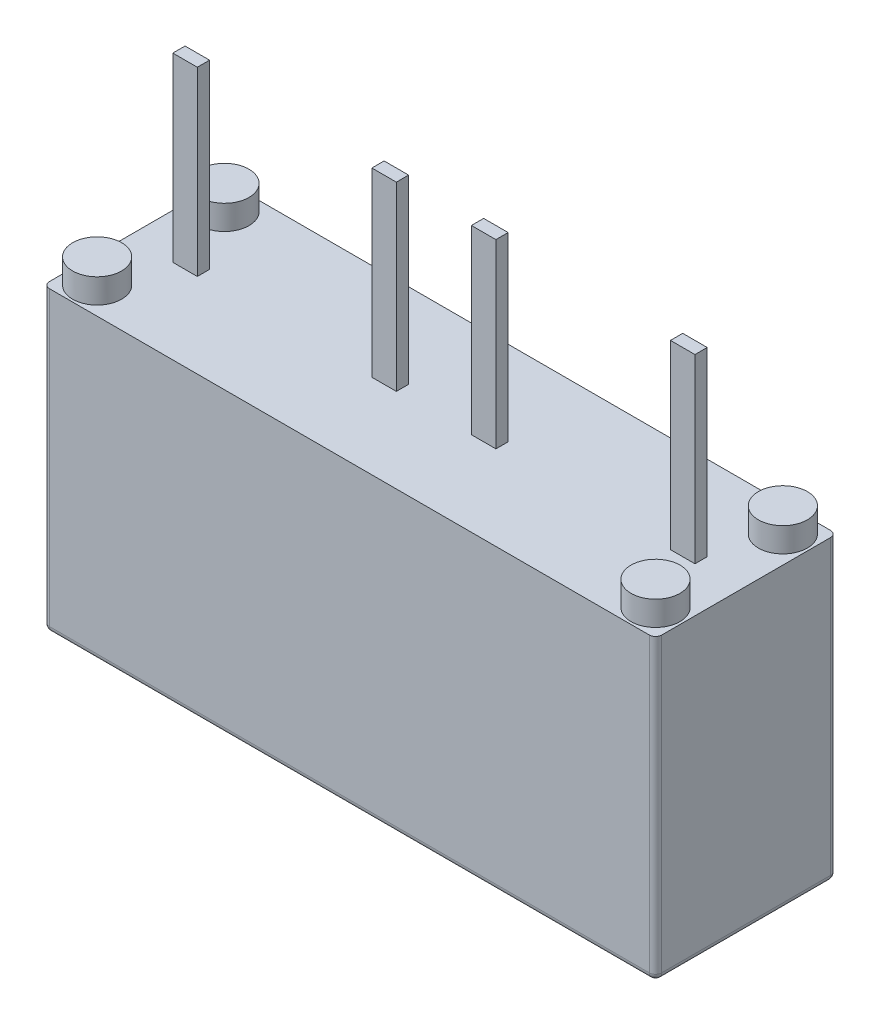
from build123d import *

# Parameters (mm, degrees)
SKETCH1_W               = 12.5
SKETCH1_H               = 3.7
BOSS_EXTRUDE1_DEPTH     = 3.05
FILLET1_R               = 0.127
SKETCH12_R              = 0.625
BOSS_EXTRUDE8_DEPTH     = 0.001
SKETCH14_W              = 0.155844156
SKETCH14_H              = 1
BOSS_EXTRUDE10_DEPTH    = 0.001
SKETCH15_W              = 0.315584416
SKETCH15_H              = 0.175324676
SKETCH15_W_2            = 0.315584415
PART_NUMBER_DEPTH       = 0.001
SKETCH2_R               = 0.5
BOSS_EXTRUDE11_DEPTH    = 0.5
MIRROR2_COPY_1_SKETCH_R = 0.5
MIRROR2_COPY_1_DEPTH    = 0.5
SKETCH16_W              = 0.5
SKETCH16_H              = 0.25
BOSS_EXTRUDE12_DEPTH    = 3.7


with BuildPart() as part:
    # Sketch1 → Boss-Extrude1 (new, symmetric)
    with BuildSketch(Plane(origin=(0, 0, 0), x_dir=(1, 0, 0), z_dir=(0, 1, 0))):
        Rectangle(SKETCH1_W, SKETCH1_H)
    extrude(amount=BOSS_EXTRUDE1_DEPTH, both=True)

    # Fillet1
    fillet1_edges = [part.edges().sort_by_distance(p)[0] for p in [
        (0, -3.05, 1.85),
        (-6.25, -3.05, 0),
        (0, -3.05, -1.85),
        (6.25, -3.05, 0),
        (6.25, 0, 1.85),
        (-6.25, 0, 1.85),
        (-6.25, 0, -1.85),
        (6.25, 0, -1.85),
    ]]
    fillet(fillet1_edges, radius=FILLET1_R)

    # Sketch12 → Boss-Extrude8 (add)
    with BuildSketch(Plane(origin=(0, -3.05, 0), x_dir=(-1, 0, 0), z_dir=(0, -1, 0))):
        with Locations(Location((5.337664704, 0.725256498, 0), (0, 0, 270))):
            Circle(SKETCH12_R)
        Polygon((-4.767808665, 0.401887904), (-5.208078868, -1.480706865), (-5.548883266, -1.401005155), (-5.270390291, -0.21016959), (-5.767010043, -0.559917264), (-5.406669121, 0.980900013), (-5.650100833, 1.037829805), (-5.134766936, 1.287763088), (-4.82243301, 0.844268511), (-5.065864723, 0.901198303), (-5.264428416, 0.05214023), align=None)
    extrude(amount=BOSS_EXTRUDE8_DEPTH)

    # Sketch14 → Boss-Extrude10 (add)
    # profile 1 of 14: a face of its own
    with BuildSketch(Plane.XZ.offset(3.05)):
        with BuildLine():
            Line((-5.930411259, 0.573168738), (-5.930411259, 1.573168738))
            Line((-5.930411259, 1.573168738), (-5.66093074, 1.573168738))
            add(Edge.make_bspline(
                [(-5.66093074, 1.573168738), (-5.648958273, 1.573126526), (-5.626026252, 1.573045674), (-5.593279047, 1.572530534), (-5.563717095, 1.571269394), (-5.537463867, 1.569706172), (-5.514446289, 1.567732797), (-5.494757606, 1.565290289), (-5.478210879, 1.562725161), (-5.468474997, 1.559990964), (-5.464096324, 1.558761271)],
                knots=[0, 0, 0, 0, 1.45237712, 2.781878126, 3.972677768, 5.041396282, 5.972228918, 6.774219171, 7.448710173, 8, 8, 8, 8], degree=3))
            add(Edge.make_bspline(
                [(-5.464096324, 1.558761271), (-5.458035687, 1.556632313), (-5.445976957, 1.552396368), (-5.428545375, 1.544172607), (-5.411950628, 1.534267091), (-5.396234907, 1.522581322), (-5.381384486, 1.509322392), (-5.36727424, 1.494433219), (-5.354210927, 1.477745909), (-5.341744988, 1.459658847), (-5.330429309, 1.440110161), (-5.320602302, 1.419076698), (-5.312610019, 1.396588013), (-5.305600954, 1.372856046), (-5.300392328, 1.347670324), (-5.296808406, 1.321155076), (-5.294527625, 1.293311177), (-5.294210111, 1.274269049), (-5.294047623, 1.264524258)],
                knots=[0, 0, 0, 0, 0.846149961, 1.683567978, 2.535100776, 3.389102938, 4.260422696, 5.155850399, 6.088615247, 7.050446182, 8.048882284, 9.061856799, 10.105243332, 11.191356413, 12.320760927, 13.490669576, 14.715852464, 16, 16, 16, 16], degree=3))
            add(Edge.make_bspline(
                [(-5.294047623, 1.264524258), (-5.294140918, 1.255658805), (-5.294324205, 1.238241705), (-5.296460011, 1.212710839), (-5.299622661, 1.188233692), (-5.304251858, 1.164897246), (-5.310400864, 1.142690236), (-5.317714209, 1.121542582), (-5.326142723, 1.101380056), (-5.336162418, 1.082542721), (-5.347087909, 1.064969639), (-5.358701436, 1.048600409), (-5.370969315, 1.033669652), (-5.383990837, 1.020115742), (-5.397405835, 1.007634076), (-5.41196814, 0.997019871), (-5.426805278, 0.987285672), (-5.44280155, 0.97895084), (-5.460659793, 0.97204105), (-5.480917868, 0.965905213), (-5.504073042, 0.960956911), (-5.530105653, 0.956998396), (-5.559013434, 0.953784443), (-5.590753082, 0.951375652), (-5.625406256, 0.949955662), (-5.649430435, 0.949848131), (-5.66194535, 0.949792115)],
                knots=[0, 0, 0, 0, 1.135396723, 2.23060449, 3.279591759, 4.295786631, 5.275377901, 6.228987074, 7.160814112, 8.071657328, 8.958908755, 9.810053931, 10.641024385, 11.43162038, 12.216736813, 12.984447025, 13.736746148, 14.488596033, 15.289898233, 16.186242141, 17.197511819, 18.320073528, 19.558272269, 20.922626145, 22.396903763, 24, 24, 24, 24], degree=3))
            Line((-5.66194535, 0.949792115), (-5.774567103, 0.949792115))
            Line((-5.774567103, 0.949792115), (-5.774567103, 0.573168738))
            Line((-5.774567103, 0.573168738), (-5.930411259, 0.573168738))
        make_face()
        with BuildLine():
            Line((-5.774567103, 1.404337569), (-5.774567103, 1.118623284))
            Line((-5.774567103, 1.118623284), (-5.672903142, 1.118623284))
            add(Edge.make_bspline(
                [(-5.672903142, 1.118623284), (-5.6647182, 1.118658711), (-5.649022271, 1.118726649), (-5.626492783, 1.119334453), (-5.605989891, 1.120318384), (-5.587514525, 1.121717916), (-5.571124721, 1.123479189), (-5.556770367, 1.125722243), (-5.544473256, 1.128237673), (-5.530894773, 1.132247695), (-5.516006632, 1.139118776), (-5.499879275, 1.149669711), (-5.48546536, 1.162927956), (-5.47285882, 1.178593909), (-5.46245361, 1.19659899), (-5.455215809, 1.216812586), (-5.450561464, 1.238811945), (-5.450120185, 1.254150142), (-5.449891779, 1.262089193)],
                knots=[0, 0, 0, 0, 1.284283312, 2.462817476, 3.536098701, 4.504784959, 5.369772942, 6.121838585, 6.783804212, 7.337847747, 8.3400838, 9.343892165, 10.350558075, 11.399797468, 12.488501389, 13.596588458, 14.755994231, 16, 16, 16, 16], degree=3))
            add(Edge.make_bspline(
                [(-5.449891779, 1.262089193), (-5.450100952, 1.270167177), (-5.450505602, 1.285794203), (-5.455423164, 1.308112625), (-5.462764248, 1.328629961), (-5.47376598, 1.346580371), (-5.486416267, 1.362380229), (-5.500703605, 1.375710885), (-5.516814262, 1.385632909), (-5.531472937, 1.392009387), (-5.544933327, 1.395790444), (-5.557675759, 1.39782975), (-5.572833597, 1.399832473), (-5.590482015, 1.401725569), (-5.610595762, 1.402825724), (-5.633194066, 1.40357807), (-5.658289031, 1.404250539), (-5.67587882, 1.404307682), (-5.685078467, 1.404337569)],
                knots=[0, 0, 0, 0, 1.217310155, 2.3549115, 3.434183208, 4.491984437, 5.51587148, 6.484436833, 7.425091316, 8.358344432, 8.888574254, 9.53159621, 10.304262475, 11.197434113, 12.210261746, 13.34451227, 14.611151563, 16, 16, 16, 16], degree=3))
            Line((-5.685078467, 1.404337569), (-5.774567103, 1.404337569))
        make_face(mode=Mode.SUBTRACT)
    # profile 2 of 14: a face of its own
    with BuildSketch(Plane.XZ.offset(3.05)):
        with Locations((-5.086255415, 1.073168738)):
            Rectangle(SKETCH14_W, SKETCH14_H)
    # profile 3 of 14: a face of its own
    with BuildSketch(Plane.XZ.offset(3.05)):
        with BuildLine():
            Line((-4.320021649, 0.936805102), (-4.164177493, 0.871870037))
            add(Edge.make_bspline(
                [(-4.164177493, 0.871870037), (-4.167396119, 0.8587699), (-4.173667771, 0.833243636), (-4.185532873, 0.79675943), (-4.198589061, 0.762907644), (-4.213526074, 0.731877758), (-4.229831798, 0.703397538), (-4.24794414, 0.677747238), (-4.267522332, 0.654795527), (-4.288677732, 0.634596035), (-4.311376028, 0.617215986), (-4.334979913, 0.601728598), (-4.360098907, 0.589032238), (-4.386381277, 0.578312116), (-4.41403365, 0.570343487), (-4.44284593, 0.564346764), (-4.472941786, 0.56091516), (-4.493443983, 0.560428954), (-4.503869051, 0.560181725)],
                knots=[0, 0, 0, 0, 1.282586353, 2.499182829, 3.646034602, 4.730797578, 5.771318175, 6.763713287, 7.712684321, 8.6363956, 9.539720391, 10.428356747, 11.317388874, 12.212151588, 13.124116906, 14.050177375, 15.008543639, 16, 16, 16, 16], degree=3))
            add(Edge.make_bspline(
                [(-4.503869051, 0.560181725), (-4.516949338, 0.560475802), (-4.542573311, 0.561051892), (-4.579963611, 0.567250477), (-4.615543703, 0.576668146), (-4.64924945, 0.590191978), (-4.681120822, 0.607478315), (-4.710821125, 0.628889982), (-4.739043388, 0.653629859), (-4.755452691, 0.672919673), (-4.763812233, 0.68274666)],
                knots=[0, 0, 0, 0, 1.053414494, 2.063614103, 3.046293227, 4.01520277, 4.983805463, 5.961130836, 6.961320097, 8, 8, 8, 8], degree=3))
            add(Edge.make_bspline(
                [(-4.763812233, 0.68274666), (-4.77300105, 0.69487931), (-4.79151277, 0.719321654), (-4.814753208, 0.759627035), (-4.834519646, 0.802928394), (-4.850697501, 0.849264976), (-4.863307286, 0.898688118), (-4.872123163, 0.951221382), (-4.877417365, 1.006839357), (-4.878109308, 1.044950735), (-4.878463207, 1.064443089)],
                knots=[0, 0, 0, 0, 0.898140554, 1.809387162, 2.740718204, 3.705966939, 4.703925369, 5.74945803, 6.848943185, 8, 8, 8, 8], degree=3))
            add(Edge.make_bspline(
                [(-4.878463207, 1.064443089), (-4.878139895, 1.085020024), (-4.877510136, 1.125100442), (-4.871840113, 1.18345372), (-4.863196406, 1.238466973), (-4.850308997, 1.289935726), (-4.834164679, 1.338155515), (-4.81421842, 1.382825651), (-4.791058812, 1.424413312), (-4.77216322, 1.449250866), (-4.762797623, 1.461561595)],
                knots=[0, 0, 0, 0, 1.171098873, 2.281104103, 3.334483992, 4.338438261, 5.297974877, 6.225356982, 7.120398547, 8, 8, 8, 8], degree=3))
            add(Edge.make_bspline(
                [(-4.762797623, 1.461561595), (-4.754294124, 1.471512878), (-4.737535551, 1.491124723), (-4.708891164, 1.516520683), (-4.678118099, 1.538108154), (-4.64522749, 1.555782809), (-4.610072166, 1.569529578), (-4.572824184, 1.579229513), (-4.533334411, 1.584952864), (-4.506323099, 1.58574866), (-4.492505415, 1.586155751)],
                knots=[0, 0, 0, 0, 1.017460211, 2.005195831, 2.96880208, 3.936538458, 4.903086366, 5.898753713, 6.925103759, 8, 8, 8, 8], degree=3))
            add(Edge.make_bspline(
                [(-4.492505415, 1.586155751), (-4.481197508, 1.585885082), (-4.458972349, 1.585353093), (-4.426383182, 1.581100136), (-4.395333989, 1.573621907), (-4.365521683, 1.563812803), (-4.337207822, 1.550688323), (-4.310310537, 1.534762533), (-4.284724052, 1.516087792), (-4.269215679, 1.501569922), (-4.261377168, 1.49423205)],
                knots=[0, 0, 0, 0, 1.062174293, 2.087653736, 3.080296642, 4.058948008, 5.03139012, 6.005719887, 6.992016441, 8, 8, 8, 8], degree=3))
            add(Edge.make_bspline(
                [(-4.261377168, 1.49423205), (-4.255927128, 1.488576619), (-4.244821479, 1.477052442), (-4.229867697, 1.457640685), (-4.21602309, 1.436262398), (-4.203535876, 1.412826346), (-4.19192691, 1.387561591), (-4.181370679, 1.360338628), (-4.172084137, 1.331095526), (-4.166853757, 1.310817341), (-4.164177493, 1.300441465)],
                knots=[0, 0, 0, 0, 0.858002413, 1.748367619, 2.673305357, 3.63929672, 4.648357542, 5.711115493, 6.828831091, 8, 8, 8, 8], degree=3))
            Line((-4.164177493, 1.300441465), (-4.320021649, 1.248493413))
            add(Edge.make_bspline(
                [(-4.320021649, 1.248493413), (-4.321486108, 1.25514464), (-4.324335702, 1.268086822), (-4.330056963, 1.286764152), (-4.337022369, 1.304111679), (-4.344600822, 1.320545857), (-4.353726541, 1.335498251), (-4.36327233, 1.349683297), (-4.374465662, 1.362250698), (-4.386291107, 1.373860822), (-4.399165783, 1.383893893), (-4.412344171, 1.39296724), (-4.426219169, 1.400511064), (-4.440732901, 1.406578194), (-4.455713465, 1.411488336), (-4.471272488, 1.414941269), (-4.487374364, 1.417032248), (-4.498316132, 1.417226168), (-4.503869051, 1.417324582)],
                knots=[0, 0, 0, 0, 1.200071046, 2.335138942, 3.437621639, 4.493482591, 5.51985659, 6.521917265, 7.50210956, 8.480124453, 9.438987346, 10.374745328, 11.297656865, 12.216555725, 13.143999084, 14.072438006, 15.021767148, 16, 16, 16, 16], degree=3))
            add(Edge.make_bspline(
                [(-4.503869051, 1.417324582), (-4.511727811, 1.417091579), (-4.527194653, 1.416633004), (-4.549854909, 1.412984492), (-4.571294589, 1.406531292), (-4.591836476, 1.398059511), (-4.611135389, 1.386772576), (-4.62940617, 1.373103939), (-4.646157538, 1.356640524), (-4.662211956, 1.338122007), (-4.676759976, 1.316665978), (-4.689112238, 1.291868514), (-4.699300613, 1.263818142), (-4.708076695, 1.232716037), (-4.714642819, 1.198357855), (-4.719199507, 1.160796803), (-4.722043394, 1.120087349), (-4.722422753, 1.091842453), (-4.722619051, 1.07722718)],
                knots=[0, 0, 0, 0, 0.827686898, 1.628972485, 2.409099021, 3.181967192, 3.964173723, 4.757978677, 5.579415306, 6.433460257, 7.33665582, 8.302235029, 9.343905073, 10.476376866, 11.703364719, 13.024698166, 14.460435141, 16, 16, 16, 16], degree=3))
            add(Edge.make_bspline(
                [(-4.722619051, 1.07722718), (-4.722397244, 1.062072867), (-4.72197011, 1.03289025), (-4.719480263, 0.990740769), (-4.714747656, 0.95201505), (-4.708689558, 0.916560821), (-4.700399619, 0.884585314), (-4.690271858, 0.856068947), (-4.678606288, 0.830733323), (-4.664690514, 0.808910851), (-4.649271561, 0.79007156), (-4.632878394, 0.773714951), (-4.615194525, 0.76005128), (-4.596693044, 0.748471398), (-4.57686601, 0.73969647), (-4.555947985, 0.733726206), (-4.534063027, 0.729596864), (-4.519040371, 0.729210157), (-4.511377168, 0.729012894)],
                knots=[0, 0, 0, 0, 1.588381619, 3.058741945, 4.422565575, 5.675514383, 6.825848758, 7.879737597, 8.8437938, 9.742560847, 10.584031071, 11.391113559, 12.163968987, 12.921455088, 13.673648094, 14.427376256, 15.197789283, 16, 16, 16, 16], degree=3))
            add(Edge.make_bspline(
                [(-4.511377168, 0.729012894), (-4.505756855, 0.729186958), (-4.49460773, 0.729532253), (-4.478201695, 0.731730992), (-4.462370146, 0.735662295), (-4.447110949, 0.741116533), (-4.432489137, 0.748312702), (-4.41835469, 0.756838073), (-4.404993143, 0.767085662), (-4.392057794, 0.778721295), (-4.379857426, 0.79210433), (-4.368707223, 0.807491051), (-4.358347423, 0.824606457), (-4.348840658, 0.843556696), (-4.340126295, 0.864219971), (-4.332442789, 0.886754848), (-4.325489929, 0.911048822), (-4.321879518, 0.928054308), (-4.320021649, 0.936805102)],
                knots=[0, 0, 0, 0, 0.874040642, 1.73385169, 2.568061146, 3.406503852, 4.248567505, 5.09821747, 5.96915136, 6.862782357, 7.800986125, 8.779254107, 9.812897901, 10.908933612, 12.073249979, 13.297367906, 14.609261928, 16, 16, 16, 16], degree=3))
        make_face()
    # profile 4 of 14: a face of its own
    with BuildSketch(Plane.XZ.offset(3.05)):
        Polygon((-4.008333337, 0.573168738), (-4.008333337, 1.573168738), (-3.852489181, 1.573168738), (-3.852489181, 1.091837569), (-3.472416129, 1.573168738), (-3.274567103, 1.573168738), (-3.58869048, 1.192081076), (-3.26158009, 0.573168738), (-3.481953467, 0.573168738), (-3.709632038, 1.045165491), (-3.852489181, 0.871870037), (-3.852489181, 0.573168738), align=None)
    # profile 5 of 14: a face of its own
    with BuildSketch(Plane.XZ.offset(3.05)):
        Polygon((-3.177164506, 0.573168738), (-3.177164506, 1.573168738), (-2.566774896, 1.573168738), (-2.566774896, 1.404337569), (-3.02132035, 1.404337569), (-3.02132035, 1.170571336), (-2.592748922, 1.170571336), (-2.592748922, 1.01472718), (-3.02132035, 1.01472718), (-3.02132035, 0.741999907), (-2.553787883, 0.741999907), (-2.553787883, 0.573168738), align=None)
    # profile 6 of 14: a face of its own
    with BuildSketch(Plane.XZ.offset(3.05)):
        with BuildLine():
            Line((-2.41093074, 0.573168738), (-2.41093074, 1.573168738))
            Line((-2.41093074, 1.573168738), (-2.059875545, 1.573168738))
            add(Edge.make_bspline(
                [(-2.059875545, 1.573168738), (-2.049052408, 1.573089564), (-2.028210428, 1.5729371), (-1.998082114, 1.571814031), (-1.97041902, 1.569488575), (-1.945064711, 1.566810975), (-1.922235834, 1.56298159), (-1.901765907, 1.558324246), (-1.883682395, 1.552948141), (-1.862708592, 1.544587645), (-1.839208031, 1.530753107), (-1.813936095, 1.50953802), (-1.791453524, 1.48325734), (-1.771718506, 1.452520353), (-1.755427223, 1.41764306), (-1.744003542, 1.37900532), (-1.736664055, 1.337178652), (-1.735965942, 1.308117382), (-1.735606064, 1.293136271)],
                knots=[0, 0, 0, 0, 1.04688713, 2.015977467, 2.915189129, 3.731617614, 4.481301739, 5.152637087, 5.761127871, 6.304197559, 7.333207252, 8.382830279, 9.482073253, 10.665313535, 11.906396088, 13.191683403, 14.552310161, 16, 16, 16, 16], degree=3))
            add(Edge.make_bspline(
                [(-1.735606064, 1.293136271), (-1.735828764, 1.283593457), (-1.736263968, 1.264944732), (-1.73884566, 1.237658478), (-1.743453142, 1.211771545), (-1.750266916, 1.187401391), (-1.758462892, 1.164271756), (-1.768911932, 1.142707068), (-1.781111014, 1.122505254), (-1.795132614, 1.103826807), (-1.810822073, 1.086684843), (-1.828173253, 1.071214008), (-1.847069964, 1.057303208), (-1.867759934, 1.045452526), (-1.889690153, 1.034714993), (-1.913401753, 1.026103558), (-1.938621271, 1.018902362), (-1.956150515, 1.015602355), (-1.965110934, 1.013915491)],
                knots=[0, 0, 0, 0, 1.148725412, 2.24485837, 3.2956961, 4.308991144, 5.287710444, 6.245445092, 7.187969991, 8.124285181, 9.052065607, 9.980417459, 10.918430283, 11.870785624, 12.846723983, 13.853982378, 14.9030207, 16, 16, 16, 16], degree=3))
            add(Edge.make_bspline(
                [(-1.965110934, 1.013915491), (-1.956227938, 1.00760899), (-1.938847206, 0.995269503), (-1.914789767, 0.975096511), (-1.893269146, 0.953953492), (-1.87678348, 0.935244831), (-1.864346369, 0.918539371), (-1.853991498, 0.903972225), (-1.842876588, 0.887089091), (-1.830857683, 0.867968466), (-1.81815825, 0.846469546), (-1.804561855, 0.82272515), (-1.790133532, 0.796654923), (-1.780300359, 0.778467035), (-1.77517587, 0.768988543)],
                knots=[0, 0, 0, 0, 1.250008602, 2.445803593, 3.598666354, 4.710220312, 5.303348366, 5.98833631, 6.761333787, 7.622934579, 8.580231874, 9.626942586, 10.763297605, 12, 12, 12, 12], degree=3))
            Line((-1.77517587, 0.768988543), (-1.670670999, 0.573168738))
            Line((-1.670670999, 0.573168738), (-1.889623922, 0.573168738))
            Line((-1.889623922, 0.573168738), (-2.005492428, 0.789483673))
            add(Edge.make_bspline(
                [(-2.005492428, 0.789483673), (-2.010478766, 0.79882835), (-2.019968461, 0.816612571), (-2.033802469, 0.841825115), (-2.046374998, 0.864248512), (-2.057485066, 0.88410925), (-2.067648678, 0.900999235), (-2.076324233, 0.915392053), (-2.083983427, 0.926848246), (-2.092248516, 0.938422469), (-2.101899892, 0.950064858), (-2.113970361, 0.961556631), (-2.126316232, 0.970811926), (-2.13963391, 0.977907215), (-2.155052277, 0.98324112), (-2.173823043, 0.986249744), (-2.196313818, 0.9886272), (-2.212599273, 0.988708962), (-2.221401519, 0.988753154)],
                knots=[0, 0, 0, 0, 1.60136501, 3.047620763, 4.347844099, 5.488187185, 6.487883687, 7.328020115, 8.028596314, 8.570701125, 9.478104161, 10.309984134, 11.085182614, 11.803449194, 12.582885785, 13.539658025, 14.670191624, 16, 16, 16, 16], degree=3))
            Line((-2.221401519, 0.988753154), (-2.255086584, 0.988753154))
            Line((-2.255086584, 0.988753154), (-2.255086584, 0.573168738))
            Line((-2.255086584, 0.573168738), (-2.41093074, 0.573168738))
        make_face()
        with BuildLine():
            Line((-2.255086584, 1.157584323), (-2.121766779, 1.157584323))
            add(Edge.make_bspline(
                [(-2.121766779, 1.157584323), (-2.112026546, 1.157641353), (-2.093492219, 1.157749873), (-2.067106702, 1.158068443), (-2.043500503, 1.158929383), (-2.022730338, 1.159904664), (-2.004657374, 1.161078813), (-1.98940683, 1.162581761), (-1.976885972, 1.164631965), (-1.963951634, 1.167453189), (-1.950238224, 1.172664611), (-1.935818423, 1.181423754), (-1.922757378, 1.192278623), (-1.911591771, 1.205832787), (-1.902300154, 1.221788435), (-1.895924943, 1.240323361), (-1.891990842, 1.26117861), (-1.891636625, 1.275868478), (-1.89145022, 1.283598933)],
                knots=[0, 0, 0, 0, 1.530151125, 2.911667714, 4.144992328, 5.240737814, 6.177978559, 6.99000054, 7.646825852, 8.170085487, 9.068012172, 9.935431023, 10.810237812, 11.723128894, 12.67998143, 13.694953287, 14.786982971, 16, 16, 16, 16], degree=3))
            add(Edge.make_bspline(
                [(-1.89145022, 1.283598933), (-1.891646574, 1.290989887), (-1.892022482, 1.305139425), (-1.895878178, 1.325214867), (-1.902361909, 1.343040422), (-1.911624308, 1.35846041), (-1.923113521, 1.37148697), (-1.936397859, 1.382539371), (-1.951618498, 1.391353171), (-1.962867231, 1.395123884), (-1.96856061, 1.397032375)],
                knots=[0, 0, 0, 0, 1.194031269, 2.285901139, 3.289564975, 4.246236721, 5.176404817, 6.085300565, 7.030903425, 8, 8, 8, 8], degree=3))
            add(Edge.make_bspline(
                [(-1.96856061, 1.397032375), (-1.971125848, 1.397599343), (-1.977231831, 1.398948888), (-1.987998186, 1.400531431), (-2.001827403, 1.40161214), (-2.018605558, 1.402623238), (-2.038361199, 1.403391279), (-2.061088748, 1.404058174), (-2.086796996, 1.404111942), (-2.10492442, 1.404259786), (-2.114461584, 1.404337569)],
                knots=[0, 0, 0, 0, 0.430892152, 1.025643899, 1.783105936, 2.70574662, 3.782977, 5.026178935, 6.435419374, 8, 8, 8, 8], degree=3))
            Line((-2.114461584, 1.404337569), (-2.255086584, 1.404337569))
            Line((-2.255086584, 1.404337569), (-2.255086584, 1.157584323))
        make_face(mode=Mode.SUBTRACT)
    # profile 7 of 14: a face of its own
    with BuildSketch(Plane.XZ.offset(3.05)):
        with Locations((-1.501839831, 1.073168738)):
            Rectangle(SKETCH14_W, SKETCH14_H)
    # profile 8 of 14: a face of its own
    with BuildSketch(Plane.XZ.offset(3.05)):
        Polygon((-1.255086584, 0.573168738), (-1.255086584, 1.573168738), (-1.092343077, 1.573168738), (-0.748593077, 0.90535218), (-0.748593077, 1.573168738), (-0.592748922, 1.573168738), (-0.592748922, 0.573168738), (-0.761174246, 0.573168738), (-1.099242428, 1.225360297), (-1.099242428, 0.573168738), align=None)
    # profile 9 of 14: a face of its own
    with BuildSketch(Plane.XZ.offset(3.05)):
        with BuildLine():
            Line((-0.047294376, 0.936805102), (-0.047294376, 1.105636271))
            Line((-0.047294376, 1.105636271), (0.303354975, 1.105636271))
            Line((0.303354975, 1.105636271), (0.303354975, 0.712779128))
            add(Edge.make_bspline(
                [(0.303354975, 0.712779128), (0.298682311, 0.707579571), (0.289244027, 0.697077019), (0.273700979, 0.682169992), (0.256630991, 0.668000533), (0.238092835, 0.654476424), (0.21832226, 0.641171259), (0.197148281, 0.628458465), (0.174398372, 0.616459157), (0.142672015, 0.601230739), (0.101918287, 0.584842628), (0.052118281, 0.570859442), (0.002276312, 0.561819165), (-0.031090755, 0.560725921), (-0.04770022, 0.560181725)],
                knots=[0, 0, 0, 0, 0.640095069, 1.292924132, 1.970305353, 2.670365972, 3.393721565, 4.15229731, 4.931044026, 5.748453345, 7.375093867, 8.945946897, 10.479752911, 12, 12, 12, 12], degree=3))
            add(Edge.make_bspline(
                [(-0.04770022, 0.560181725), (-0.057648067, 0.560409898), (-0.07730736, 0.56086082), (-0.106414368, 0.563444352), (-0.134608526, 0.568149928), (-0.161885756, 0.574605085), (-0.188228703, 0.583049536), (-0.21383544, 0.593055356), (-0.238333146, 0.605385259), (-0.262087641, 0.619112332), (-0.284504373, 0.635095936), (-0.306194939, 0.652425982), (-0.326274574, 0.672072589), (-0.345115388, 0.693480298), (-0.363126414, 0.716458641), (-0.379741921, 0.741424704), (-0.394901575, 0.768390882), (-0.409122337, 0.796915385), (-0.421894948, 0.827038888), (-0.432783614, 0.858603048), (-0.442223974, 0.891353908), (-0.449640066, 0.925540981), (-0.455498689, 0.960965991), (-0.459731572, 0.997669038), (-0.462488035, 1.035653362), (-0.462747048, 1.061461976), (-0.462878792, 1.074589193)],
                knots=[0, 0, 0, 0, 0.96294793, 1.903012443, 2.825402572, 3.727352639, 4.613530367, 5.501013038, 6.385229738, 7.265535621, 8.153718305, 9.047361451, 9.95019023, 10.868482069, 11.806149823, 12.77395942, 13.767900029, 14.798508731, 15.857606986, 16.932193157, 18.028419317, 19.154653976, 20.31598268, 21.50241393, 22.729635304, 24, 24, 24, 24], degree=3))
            add(Edge.make_bspline(
                [(-0.462878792, 1.074589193), (-0.46274577, 1.087986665), (-0.46248416, 1.114335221), (-0.459748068, 1.153066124), (-0.455483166, 1.190370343), (-0.449768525, 1.226182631), (-0.441894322, 1.260482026), (-0.432730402, 1.293351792), (-0.421463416, 1.324683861), (-0.408726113, 1.35450231), (-0.394513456, 1.382632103), (-0.379298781, 1.409070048), (-0.363136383, 1.433683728), (-0.345721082, 1.456291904), (-0.327593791, 1.477273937), (-0.308111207, 1.49617588), (-0.287933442, 1.513550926), (-0.26640474, 1.528733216), (-0.244121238, 1.542539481), (-0.220413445, 1.553970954), (-0.195854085, 1.564011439), (-0.170134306, 1.572140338), (-0.143334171, 1.578425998), (-0.115448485, 1.582769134), (-0.086593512, 1.585822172), (-0.066986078, 1.586043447), (-0.057034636, 1.586155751)],
                knots=[0, 0, 0, 0, 1.312030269, 2.580345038, 3.800688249, 4.988959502, 6.130087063, 7.24577612, 8.3291513, 9.388705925, 10.419771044, 11.414082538, 12.375082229, 13.301312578, 14.207494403, 15.088254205, 15.957754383, 16.812618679, 17.66591557, 18.52219064, 19.38705966, 20.262872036, 21.161173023, 22.080434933, 23.025755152, 24, 24, 24, 24], degree=3))
            add(Edge.make_bspline(
                [(-0.057034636, 1.586155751), (-0.045121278, 1.585929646), (-0.021912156, 1.585489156), (0.012045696, 1.58183497), (0.044100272, 1.575460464), (0.074506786, 1.567143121), (0.102902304, 1.555773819), (0.129668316, 1.542261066), (0.154430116, 1.525875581), (0.177544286, 1.507345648), (0.198733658, 1.486364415), (0.217842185, 1.462917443), (0.234878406, 1.437151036), (0.250284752, 1.409300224), (0.263073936, 1.378764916), (0.27456124, 1.346182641), (0.283615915, 1.31111288), (0.288081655, 1.286875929), (0.290367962, 1.274467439)],
                knots=[0, 0, 0, 0, 1.106718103, 2.156063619, 3.167949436, 4.140832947, 5.080279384, 6.00497985, 6.921830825, 7.833627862, 8.753510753, 9.686947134, 10.638631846, 11.620184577, 12.639304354, 13.710570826, 14.827890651, 16, 16, 16, 16], degree=3))
            Line((0.290367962, 1.274467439), (0.134523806, 1.248493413))
            add(Edge.make_bspline(
                [(0.134523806, 1.248493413), (0.132849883, 1.255145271), (0.129573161, 1.26816636), (0.123317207, 1.286939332), (0.115660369, 1.304386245), (0.107508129, 1.320861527), (0.098087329, 1.335981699), (0.087643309, 1.349847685), (0.076379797, 1.362685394), (0.06389533, 1.374050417), (0.050682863, 1.384156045), (0.036969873, 1.393234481), (0.022319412, 1.400403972), (0.007407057, 1.406911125), (-0.008387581, 1.411434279), (-0.024705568, 1.414980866), (-0.041696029, 1.417014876), (-0.053241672, 1.41722076), (-0.059063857, 1.417324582)],
                knots=[0, 0, 0, 0, 1.177468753, 2.304908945, 3.392157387, 4.44646936, 5.458353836, 6.445477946, 7.424370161, 8.386026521, 9.338381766, 10.278981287, 11.203455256, 12.135194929, 13.068453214, 14.018255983, 15.000655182, 16, 16, 16, 16], degree=3))
            add(Edge.make_bspline(
                [(-0.059063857, 1.417324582), (-0.06807356, 1.417112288), (-0.085773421, 1.416695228), (-0.111647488, 1.412775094), (-0.136173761, 1.406206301), (-0.1594658, 1.397336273), (-0.181365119, 1.385609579), (-0.201906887, 1.371353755), (-0.221124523, 1.354508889), (-0.239045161, 1.335257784), (-0.255115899, 1.313194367), (-0.26916576, 1.288504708), (-0.280923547, 1.261127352), (-0.29040858, 1.231055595), (-0.297855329, 1.198267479), (-0.303257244, 1.162805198), (-0.306551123, 1.124638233), (-0.306869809, 1.098337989), (-0.307034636, 1.084735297)],
                knots=[0, 0, 0, 0, 0.921848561, 1.811002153, 2.670935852, 3.517043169, 4.356494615, 5.20737657, 6.07109315, 6.967737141, 7.894254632, 8.858726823, 9.869747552, 10.938357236, 12.082205, 13.308268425, 14.607815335, 16, 16, 16, 16], degree=3))
            add(Edge.make_bspline(
                [(-0.307034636, 1.084735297), (-0.306798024, 1.070117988), (-0.306339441, 1.041787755), (-0.302893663, 1.000636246), (-0.297106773, 0.962165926), (-0.288775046, 0.926357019), (-0.278324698, 0.893178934), (-0.265482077, 0.862720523), (-0.250453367, 0.834822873), (-0.238046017, 0.818296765), (-0.231953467, 0.810181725)],
                knots=[0, 0, 0, 0, 1.209924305, 2.344989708, 3.415650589, 4.427521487, 5.38553267, 6.291346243, 7.16097645, 8, 8, 8, 8], degree=3))
            add(Edge.make_bspline(
                [(-0.231953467, 0.810181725), (-0.226494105, 0.803675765), (-0.215763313, 0.790887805), (-0.19723048, 0.774499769), (-0.177683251, 0.760183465), (-0.156362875, 0.748879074), (-0.133736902, 0.739812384), (-0.109582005, 0.733641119), (-0.084091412, 0.729609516), (-0.066588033, 0.72921467), (-0.057643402, 0.729012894)],
                knots=[0, 0, 0, 0, 1.020747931, 2.006357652, 2.968701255, 3.930183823, 4.9021189, 5.895229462, 6.924413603, 8, 8, 8, 8], degree=3))
            add(Edge.make_bspline(
                [(-0.057643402, 0.729012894), (-0.049035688, 0.729292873), (-0.031516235, 0.729862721), (-0.005101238, 0.734403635), (0.021866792, 0.741317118), (0.049048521, 0.751002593), (0.075656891, 0.763294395), (0.101270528, 0.777521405), (0.125261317, 0.793978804), (0.140098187, 0.806407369), (0.147510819, 0.81261679)],
                knots=[0, 0, 0, 0, 0.913346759, 1.858953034, 2.837757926, 3.866620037, 4.917326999, 5.946088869, 6.973847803, 8, 8, 8, 8], degree=3))
            Line((0.147510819, 0.81261679), (0.147510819, 0.936805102))
            Line((0.147510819, 0.936805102), (-0.047294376, 0.936805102))
        make_face()
    # profile 10 of 14: a face of its own
    with BuildSketch(Plane.XZ.offset(3.05)):
        Polygon((1.306378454, 0.573168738), (1.098383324, 1.573168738), (1.256865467, 1.573168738), (1.390591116, 0.881204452), (1.534259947, 1.573168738), (1.741037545, 1.573168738), (1.88409761, 0.868217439), (2.017823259, 1.573168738), (2.176305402, 1.573168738), (1.971557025, 0.573168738), (1.79034761, 0.573168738), (1.637344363, 1.32722718), (1.480891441, 0.573168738), align=None)
    # profile 11 of 14: a face of its own
    with BuildSketch(Plane.XZ.offset(3.05)):
        Polygon((2.343837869, 0.573168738), (2.343837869, 1.573168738), (2.499682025, 1.573168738), (2.499682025, 1.05084731), (2.699966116, 1.300441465), (2.895785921, 1.300441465), (2.685761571, 1.039077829), (2.908772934, 0.573168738), (2.740550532, 0.573168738), (2.580445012, 0.907381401), (2.499682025, 0.806934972), (2.499682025, 0.573168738), align=None)
    # profile 12 of 14: a face of its own
    with BuildSketch(Plane.XZ.offset(3.05)):
        Polygon((2.965915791, 0.560181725), (3.17086709, 1.586155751), (3.303578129, 1.586155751), (3.09862683, 0.560181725), align=None)
    # profile 13 of 14: a face of its own
    with BuildSketch(Plane.XZ.offset(3.05)):
        Polygon((3.678902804, 0.573168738), (3.678902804, 0.985100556), (3.380201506, 1.573168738), (3.553699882, 1.573168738), (3.764535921, 1.164686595), (3.960152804, 1.573168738), (4.133448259, 1.573168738), (3.83474696, 0.983680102), (3.83474696, 0.573168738), align=None)
    # profile 14 of 14: a face of its own
    with BuildSketch(Plane.XZ.offset(3.05)):
        with BuildLine():
            Line((4.456824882, 0.573168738), (4.300980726, 0.573168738))
            Line((4.300980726, 0.573168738), (4.300980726, 1.300441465))
            Line((4.300980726, 1.300441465), (4.443837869, 1.300441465))
            Line((4.443837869, 1.300441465), (4.443837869, 1.197154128))
            add(Edge.make_bspline(
                [(4.443837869, 1.197154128), (4.446864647, 1.202912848), (4.45269446, 1.214004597), (4.461366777, 1.229835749), (4.469805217, 1.244159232), (4.478419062, 1.256555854), (4.486219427, 1.267770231), (4.49422271, 1.277088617), (4.501829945, 1.285010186), (4.511527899, 1.293439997), (4.52435564, 1.301425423), (4.54074876, 1.308477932), (4.558425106, 1.312589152), (4.570575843, 1.313145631), (4.57675183, 1.313428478)],
                knots=[0, 0, 0, 0, 1.247976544, 2.403700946, 3.462962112, 4.43467857, 5.299009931, 6.081551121, 6.788109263, 7.404564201, 8.542080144, 9.670008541, 10.815710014, 12, 12, 12, 12], degree=3))
            add(Edge.make_bspline(
                [(4.57675183, 1.313428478), (4.58552824, 1.313026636), (4.603086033, 1.312222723), (4.62887778, 1.304746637), (4.654167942, 1.293435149), (4.669644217, 1.282651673), (4.677604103, 1.277105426)],
                knots=[0, 0, 0, 0, 0.96387831, 1.928302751, 2.934467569, 4, 4, 4, 4], degree=3))
            Line((4.677604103, 1.277105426), (4.628294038, 1.113144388))
            add(Edge.make_bspline(
                [(4.628294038, 1.113144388), (4.622276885, 1.117950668), (4.610903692, 1.127035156), (4.592616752, 1.136807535), (4.574881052, 1.143288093), (4.563002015, 1.144171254), (4.557271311, 1.14459731)],
                knots=[0, 0, 0, 0, 1.164920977, 2.201850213, 3.13253367, 4, 4, 4, 4], degree=3))
            add(Edge.make_bspline(
                [(4.557271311, 1.14459731), (4.552157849, 1.144365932), (4.541978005, 1.143905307), (4.527384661, 1.138881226), (4.513642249, 1.131274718), (4.501000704, 1.120154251), (4.48949515, 1.105106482), (4.480441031, 1.084993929), (4.472613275, 1.060363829), (4.467774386, 1.036236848), (4.464730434, 1.013476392), (4.46247672, 0.992506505), (4.460713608, 0.968208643), (4.459379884, 0.94059977), (4.458107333, 0.909689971), (4.457335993, 0.875390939), (4.456986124, 0.837712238), (4.456880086, 0.811466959), (4.456824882, 0.797803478)],
                knots=[0, 0, 0, 0, 0.622595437, 1.239458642, 1.864845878, 2.532755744, 3.28162568, 4.161487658, 5.21226045, 6.436118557, 7.162012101, 8.018184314, 9.012812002, 10.138387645, 11.395699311, 12.792934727, 14.330378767, 16, 16, 16, 16], degree=3))
            Line((4.456824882, 0.797803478), (4.456824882, 0.573168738))
        make_face()
    extrude(amount=BOSS_EXTRUDE10_DEPTH)

    # Sketch15 → Part Number (add)
    # profile 1 of 12: a face of its own
    with BuildSketch(Plane.XZ.offset(3.05)):
        with BuildLine():
            Line((-4.109090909, -1.323), (-4.284415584, -1.323))
            Line((-4.284415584, -1.323), (-4.284415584, -0.668454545))
            add(Edge.make_bspline(
                [(-4.284415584, -0.668454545), (-4.292496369, -0.675607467), (-4.308602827, -0.689864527), (-4.334109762, -0.709600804), (-4.360502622, -0.727843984), (-4.387974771, -0.744497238), (-4.416094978, -0.760044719), (-4.44532349, -0.773957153), (-4.475427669, -0.786437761), (-4.496103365, -0.793484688), (-4.506493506, -0.797025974)],
                knots=[0, 0, 0, 0, 1.001509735, 1.996189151, 2.991510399, 3.978083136, 4.977007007, 5.972841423, 6.981293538, 8, 8, 8, 8], degree=3))
            Line((-4.506493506, -0.797025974), (-4.506493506, -0.645077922))
            add(Edge.make_bspline(
                [(-4.506493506, -0.645077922), (-4.494219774, -0.640626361), (-4.468960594, -0.631465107), (-4.431731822, -0.612610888), (-4.39395177, -0.589286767), (-4.362631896, -0.566639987), (-4.338134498, -0.546622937), (-4.320940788, -0.530700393), (-4.305125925, -0.514239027), (-4.290935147, -0.497126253), (-4.278207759, -0.479411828), (-4.266926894, -0.461260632), (-4.257065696, -0.442489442), (-4.251802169, -0.429500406), (-4.249168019, -0.423)],
                knots=[0, 0, 0, 0, 1.342253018, 2.762339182, 4.28336265, 5.906997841, 6.73458361, 7.536776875, 8.316428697, 9.08145313, 9.821906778, 10.558829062, 11.278761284, 12, 12, 12, 12], degree=3))
            Line((-4.249168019, -0.423), (-4.109090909, -0.423))
            Line((-4.109090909, -0.423), (-4.109090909, -1.323))
        make_face()
    # profile 2 of 12: a face of its own
    with BuildSketch(Plane.XZ.offset(3.05)):
        with BuildLine():
            Line((-3.793506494, -1.089233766), (-3.618181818, -1.065857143))
            add(Edge.make_bspline(
                [(-3.618181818, -1.065857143), (-3.616929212, -1.075706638), (-3.614545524, -1.094450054), (-3.606938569, -1.120551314), (-3.595855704, -1.142942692), (-3.581793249, -1.161575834), (-3.56519132, -1.176118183), (-3.547075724, -1.186774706), (-3.527371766, -1.193377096), (-3.51370674, -1.19407479), (-3.506777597, -1.194428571)],
                knots=[0, 0, 0, 0, 1.267629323, 2.412276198, 3.456104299, 4.444224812, 5.375938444, 6.257992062, 7.116677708, 8, 8, 8, 8], degree=3))
            add(Edge.make_bspline(
                [(-3.506777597, -1.194428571), (-3.502992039, -1.194359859), (-3.495486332, -1.194223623), (-3.484491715, -1.192017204), (-3.473849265, -1.189014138), (-3.463712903, -1.184586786), (-3.454193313, -1.178795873), (-3.444895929, -1.172025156), (-3.436255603, -1.163759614), (-3.427933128, -1.154447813), (-3.420551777, -1.143860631), (-3.41390365, -1.132354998), (-3.408486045, -1.119814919), (-3.403819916, -1.106416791), (-3.400476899, -1.091949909), (-3.397863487, -1.076590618), (-3.39645343, -1.060282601), (-3.396222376, -1.049118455), (-3.396103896, -1.043393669)],
                knots=[0, 0, 0, 0, 0.867416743, 1.719845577, 2.564449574, 3.403020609, 4.249010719, 5.118226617, 6.037663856, 6.988117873, 7.980682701, 8.994658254, 10.033274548, 11.111557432, 12.247002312, 13.437030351, 14.685752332, 16, 16, 16, 16], degree=3))
            add(Edge.make_bspline(
                [(-3.396103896, -1.043393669), (-3.396486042, -1.032959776), (-3.397211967, -1.013139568), (-3.402731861, -0.985008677), (-3.412713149, -0.960520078), (-3.426190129, -0.93973362), (-3.44251758, -0.923203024), (-3.460697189, -0.910817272), (-3.481000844, -0.903600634), (-3.495096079, -0.902683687), (-3.502211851, -0.902220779)],
                knots=[0, 0, 0, 0, 1.270953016, 2.414300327, 3.472121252, 4.473984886, 5.412803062, 6.285035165, 7.134225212, 8, 8, 8, 8], degree=3))
            add(Edge.make_bspline(
                [(-3.502211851, -0.902220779), (-3.507275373, -0.902346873), (-3.517949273, -0.902612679), (-3.5345764, -0.905503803), (-3.552672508, -0.909388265), (-3.565001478, -0.913200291), (-3.571428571, -0.9151875)],
                knots=[0, 0, 0, 0, 0.85882803, 1.81040837, 2.8585658, 4, 4, 4, 4], degree=3))
            Line((-3.571428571, -0.9151875), (-3.553165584, -0.761961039))
            add(Edge.make_bspline(
                [(-3.553165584, -0.761961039), (-3.543336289, -0.761837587), (-3.524630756, -0.761602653), (-3.498162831, -0.756534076), (-3.47449332, -0.748317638), (-3.461323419, -0.73919244), (-3.454910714, -0.734749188)],
                knots=[0, 0, 0, 0, 1.133310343, 2.15673376, 3.102474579, 4, 4, 4, 4], degree=3))
            add(Edge.make_bspline(
                [(-3.454910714, -0.734749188), (-3.449442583, -0.729826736), (-3.438568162, -0.720037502), (-3.427392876, -0.70071351), (-3.420566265, -0.678713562), (-3.419852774, -0.663090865), (-3.419480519, -0.654939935)],
                knots=[0, 0, 0, 0, 0.971358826, 1.931731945, 2.920909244, 4, 4, 4, 4], degree=3))
            add(Edge.make_bspline(
                [(-3.419480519, -0.654939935), (-3.419734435, -0.648142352), (-3.420223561, -0.635047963), (-3.42568844, -0.616676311), (-3.434446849, -0.600568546), (-3.446731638, -0.587269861), (-3.461381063, -0.576373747), (-3.47836993, -0.568640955), (-3.497335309, -0.563965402), (-3.510645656, -0.563500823), (-3.51755276, -0.56325974)],
                knots=[0, 0, 0, 0, 1.075989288, 2.072710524, 3.011158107, 3.962007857, 4.922430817, 5.890791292, 6.905473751, 8, 8, 8, 8], degree=3))
            add(Edge.make_bspline(
                [(-3.51755276, -0.56325974), (-3.524530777, -0.563593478), (-3.538226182, -0.564248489), (-3.558053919, -0.569982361), (-3.576348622, -0.579420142), (-3.592872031, -0.592571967), (-3.607444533, -0.609089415), (-3.618300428, -0.629724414), (-3.626333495, -0.653649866), (-3.62865061, -0.671007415), (-3.62987013, -0.680142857)],
                knots=[0, 0, 0, 0, 0.93222934, 1.829639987, 2.736832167, 3.670661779, 4.640842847, 5.66155494, 6.769254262, 8, 8, 8, 8], degree=3))
            Line((-3.62987013, -0.680142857), (-3.781818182, -0.656766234))
            add(Edge.make_bspline(
                [(-3.781818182, -0.656766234), (-3.779692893, -0.646873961), (-3.775552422, -0.627601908), (-3.767390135, -0.599955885), (-3.757422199, -0.574515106), (-3.746403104, -0.551014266), (-3.733708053, -0.529694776), (-3.719678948, -0.510402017), (-3.704023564, -0.493291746), (-3.686987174, -0.478244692), (-3.668526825, -0.465246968), (-3.648997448, -0.453873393), (-3.628217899, -0.444410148), (-3.606392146, -0.436441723), (-3.583307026, -0.43052877), (-3.559150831, -0.426097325), (-3.533861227, -0.423553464), (-3.516645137, -0.423186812), (-3.507873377, -0.423)],
                knots=[0, 0, 0, 0, 1.222838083, 2.38232415, 3.479687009, 4.52311912, 5.516350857, 6.474533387, 7.401694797, 8.314107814, 9.21661468, 10.126650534, 11.042026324, 11.973150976, 12.931644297, 13.918942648, 14.939681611, 16, 16, 16, 16], degree=3))
            add(Edge.make_bspline(
                [(-3.507873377, -0.423), (-3.498002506, -0.423201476), (-3.478751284, -0.423594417), (-3.450691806, -0.426908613), (-3.424211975, -0.432479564), (-3.399137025, -0.439750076), (-3.375749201, -0.449784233), (-3.353972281, -0.461848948), (-3.333623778, -0.47600992), (-3.315230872, -0.492356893), (-3.298819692, -0.510063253), (-3.283996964, -0.528049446), (-3.271792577, -0.546803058), (-3.261533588, -0.565844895), (-3.253920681, -0.585589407), (-3.248150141, -0.605665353), (-3.244795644, -0.626276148), (-3.24436956, -0.640135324), (-3.244155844, -0.647086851)],
                knots=[0, 0, 0, 0, 1.230769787, 2.400378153, 3.517119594, 4.602822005, 5.650564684, 6.683681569, 7.703094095, 8.735848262, 9.74563128, 10.71198263, 11.638503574, 12.531701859, 13.404401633, 14.272067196, 15.133298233, 16, 16, 16, 16], degree=3))
            add(Edge.make_bspline(
                [(-3.244155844, -0.647086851), (-3.244507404, -0.656439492), (-3.245200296, -0.674872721), (-3.251767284, -0.701716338), (-3.261982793, -0.727239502), (-3.276722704, -0.751147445), (-3.295322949, -0.773684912), (-3.318454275, -0.794243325), (-3.345098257, -0.81405529), (-3.365210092, -0.825086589), (-3.375649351, -0.8308125)],
                knots=[0, 0, 0, 0, 0.939706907, 1.852079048, 2.764430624, 3.6963375, 4.66659835, 5.694335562, 6.803220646, 8, 8, 8, 8], degree=3))
            add(Edge.make_bspline(
                [(-3.375649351, -0.8308125), (-3.369586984, -0.832274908), (-3.357604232, -0.835165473), (-3.340460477, -0.84154161), (-3.324067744, -0.848843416), (-3.308535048, -0.857351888), (-3.29399367, -0.867429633), (-3.28016484, -0.878432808), (-3.267208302, -0.890846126), (-3.255332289, -0.904477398), (-3.244190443, -0.918982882), (-3.235026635, -0.93483279), (-3.226867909, -0.951304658), (-3.220239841, -0.968713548), (-3.215411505, -0.987112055), (-3.211732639, -1.006262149), (-3.209483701, -1.026355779), (-3.209223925, -1.040039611), (-3.209090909, -1.047046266)],
                knots=[0, 0, 0, 0, 1.008493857, 1.993368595, 2.954750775, 3.911730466, 4.854556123, 5.81472584, 6.769420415, 7.753752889, 8.739021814, 9.724142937, 10.711183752, 11.712141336, 12.73269162, 13.785823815, 14.86625554, 16, 16, 16, 16], degree=3))
            add(Edge.make_bspline(
                [(-3.209090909, -1.047046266), (-3.209288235, -1.05723024), (-3.209675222, -1.077202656), (-3.21414698, -1.106407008), (-3.220724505, -1.134391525), (-3.230584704, -1.160942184), (-3.242776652, -1.186302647), (-3.257916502, -1.210253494), (-3.275883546, -1.232709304), (-3.296321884, -1.253535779), (-3.318320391, -1.27264947), (-3.34191994, -1.289109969), (-3.366376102, -1.303357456), (-3.392128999, -1.314587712), (-3.418728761, -1.323688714), (-3.446452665, -1.33002542), (-3.475190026, -1.33397571), (-3.494711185, -1.334448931), (-3.504586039, -1.334688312)],
                knots=[0, 0, 0, 0, 1.062416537, 2.08357036, 3.077923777, 4.059209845, 5.034279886, 6.011233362, 7.010854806, 8.03119724, 9.05430762, 10.04888448, 11.031219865, 12.00444434, 12.977295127, 13.96252575, 14.969335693, 16, 16, 16, 16], degree=3))
            add(Edge.make_bspline(
                [(-3.504586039, -1.334688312), (-3.514030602, -1.334471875), (-3.532606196, -1.334046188), (-3.55990502, -1.330865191), (-3.586108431, -1.325772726), (-3.6112699, -1.31869183), (-3.63525798, -1.309300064), (-3.658186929, -1.297952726), (-3.679998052, -1.28455035), (-3.700585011, -1.269275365), (-3.719614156, -1.252204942), (-3.736429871, -1.233236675), (-3.751365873, -1.212946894), (-3.763912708, -1.190975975), (-3.774875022, -1.167813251), (-3.783132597, -1.142933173), (-3.789677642, -1.116684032), (-3.792211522, -1.098517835), (-3.793506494, -1.089233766)],
                knots=[0, 0, 0, 0, 1.083411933, 2.130857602, 3.148610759, 4.143507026, 5.125373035, 6.099933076, 7.075018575, 8.058448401, 9.037577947, 10.002175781, 10.961931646, 11.922703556, 12.90078625, 13.896932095, 14.925200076, 16, 16, 16, 16], degree=3))
        make_face()
    # profile 3 of 12: a face of its own
    with BuildSketch(Plane.XZ.offset(3.05)):
        with BuildLine():
            Line((-2.58961039, -1.323), (-2.764935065, -1.323))
            Line((-2.764935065, -1.323), (-2.764935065, -0.668454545))
            add(Edge.make_bspline(
                [(-2.764935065, -0.668454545), (-2.77301585, -0.675607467), (-2.789122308, -0.689864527), (-2.814629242, -0.709600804), (-2.841022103, -0.727843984), (-2.868494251, -0.744497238), (-2.896614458, -0.760044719), (-2.925842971, -0.773957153), (-2.955947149, -0.786437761), (-2.976622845, -0.793484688), (-2.987012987, -0.797025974)],
                knots=[0, 0, 0, 0, 1.001509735, 1.996189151, 2.991510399, 3.978083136, 4.977007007, 5.972841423, 6.981293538, 8, 8, 8, 8], degree=3))
            Line((-2.987012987, -0.797025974), (-2.987012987, -0.645077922))
            add(Edge.make_bspline(
                [(-2.987012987, -0.645077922), (-2.974739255, -0.640626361), (-2.949480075, -0.631465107), (-2.912251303, -0.612610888), (-2.87447125, -0.589286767), (-2.843151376, -0.566639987), (-2.818653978, -0.546622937), (-2.801460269, -0.530700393), (-2.785645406, -0.514239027), (-2.771454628, -0.497126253), (-2.758727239, -0.479411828), (-2.747446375, -0.461260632), (-2.737585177, -0.442489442), (-2.732321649, -0.429500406), (-2.7296875, -0.423)],
                knots=[0, 0, 0, 0, 1.342253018, 2.762339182, 4.28336265, 5.906997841, 6.73458361, 7.536776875, 8.316428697, 9.08145313, 9.821906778, 10.558829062, 11.278761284, 12, 12, 12, 12], degree=3))
            Line((-2.7296875, -0.423), (-2.58961039, -0.423))
            Line((-2.58961039, -0.423), (-2.58961039, -1.323))
        make_face()
    # profile 4 of 12: a face of its own
    with BuildSketch(Plane.XZ.offset(3.05)):
        with Locations((-2.116233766, -0.989883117)):
            Rectangle(SKETCH15_W, SKETCH15_H)
    # profile 5 of 12: a face of its own
    with BuildSketch(Plane.XZ.offset(3.05)):
        with BuildLine():
            Line((-1.338961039, -1.323), (-1.514285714, -1.323))
            Line((-1.514285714, -1.323), (-1.514285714, -0.668454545))
            add(Edge.make_bspline(
                [(-1.514285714, -0.668454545), (-1.522366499, -0.675607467), (-1.538472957, -0.689864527), (-1.563979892, -0.709600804), (-1.590372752, -0.727843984), (-1.6178449, -0.744497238), (-1.645965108, -0.760044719), (-1.67519362, -0.773957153), (-1.705297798, -0.786437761), (-1.725973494, -0.793484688), (-1.736363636, -0.797025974)],
                knots=[0, 0, 0, 0, 1.001509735, 1.996189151, 2.991510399, 3.978083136, 4.977007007, 5.972841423, 6.981293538, 8, 8, 8, 8], degree=3))
            Line((-1.736363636, -0.797025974), (-1.736363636, -0.645077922))
            add(Edge.make_bspline(
                [(-1.736363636, -0.645077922), (-1.724089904, -0.640626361), (-1.698830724, -0.631465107), (-1.661601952, -0.612610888), (-1.6238219, -0.589286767), (-1.592502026, -0.566639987), (-1.568004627, -0.546622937), (-1.550810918, -0.530700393), (-1.534996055, -0.514239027), (-1.520805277, -0.497126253), (-1.508077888, -0.479411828), (-1.496797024, -0.461260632), (-1.486935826, -0.442489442), (-1.481672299, -0.429500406), (-1.479038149, -0.423)],
                knots=[0, 0, 0, 0, 1.342253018, 2.762339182, 4.28336265, 5.906997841, 6.73458361, 7.536776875, 8.316428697, 9.08145313, 9.821906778, 10.558829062, 11.278761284, 12, 12, 12, 12], degree=3))
            Line((-1.479038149, -0.423), (-1.338961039, -0.423))
            Line((-1.338961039, -0.423), (-1.338961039, -1.323))
        make_face()
    # profile 6 of 12: a face of its own
    with BuildSketch(Plane.XZ.offset(3.05)):
        with Locations((-0.865584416, -0.989883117)):
            Rectangle(SKETCH15_W_2, SKETCH15_H)
    # profile 7 of 12: a face of its own
    with BuildSketch(Plane.XZ.offset(3.05)):
        Polygon((0.297402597, -1.323), (0.101075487, -1.323), (0.031310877, -1.124298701), (-0.312581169, -1.124298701), (-0.382345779, -1.323), (-0.579220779, -1.323), (-0.251034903, -0.423), (-0.031513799, -0.423), align=None)
        Polygon((-0.022199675, -0.972350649), (-0.140909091, -0.635033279), (-0.259253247, -0.972350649), align=None, mode=Mode.SUBTRACT)
    # profile 8 of 12: a face of its own
    with BuildSketch(Plane.XZ.offset(3.05)):
        with Locations((0.583766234, -0.989883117)):
            Rectangle(SKETCH15_W, SKETCH15_H)
    # profile 9 of 12: a face of its own
    with BuildSketch(Plane.XZ.offset(3.05)):
        Polygon((0.87012987, -1.323), (1.173112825, -0.84542289), (0.905194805, -0.423), (1.117593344, -0.423), (1.279220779, -0.677951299), (1.440848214, -0.423), (1.653246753, -0.423), (1.385511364, -0.84542289), (1.688311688, -1.323), (1.475913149, -1.323), (1.279220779, -1.012894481), (1.082528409, -1.323), align=None)
    # profile 10 of 12: a face of its own
    with BuildSketch(Plane.XZ.offset(3.05)):
        Polygon((1.758441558, -1.334688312), (1.965726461, -0.411311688), (2.109090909, -0.411311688), (1.901806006, -1.334688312), align=None)
    # profile 11 of 12: a face of its own
    with BuildSketch(Plane.XZ.offset(3.05)):
        with BuildLine():
            Line((2.681818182, -1.323), (2.506493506, -1.323))
            Line((2.506493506, -1.323), (2.506493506, -0.668454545))
            add(Edge.make_bspline(
                [(2.506493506, -0.668454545), (2.498412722, -0.675607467), (2.482306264, -0.689864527), (2.456799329, -0.709600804), (2.430406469, -0.727843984), (2.40293432, -0.744497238), (2.374814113, -0.760044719), (2.345585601, -0.773957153), (2.315481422, -0.786437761), (2.294805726, -0.793484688), (2.284415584, -0.797025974)],
                knots=[0, 0, 0, 0, 1.001509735, 1.996189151, 2.991510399, 3.978083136, 4.977007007, 5.972841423, 6.981293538, 8, 8, 8, 8], degree=3))
            Line((2.284415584, -0.797025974), (2.284415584, -0.645077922))
            add(Edge.make_bspline(
                [(2.284415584, -0.645077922), (2.296689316, -0.640626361), (2.321948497, -0.631465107), (2.359177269, -0.612610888), (2.396957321, -0.589286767), (2.428277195, -0.566639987), (2.452774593, -0.546622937), (2.469968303, -0.530700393), (2.485783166, -0.514239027), (2.499973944, -0.497126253), (2.512701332, -0.479411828), (2.523982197, -0.461260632), (2.533843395, -0.442489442), (2.539106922, -0.429500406), (2.541741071, -0.423)],
                knots=[0, 0, 0, 0, 1.342253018, 2.762339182, 4.28336265, 5.906997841, 6.73458361, 7.536776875, 8.316428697, 9.08145313, 9.821906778, 10.558829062, 11.278761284, 12, 12, 12, 12], degree=3))
            Line((2.541741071, -0.423), (2.681818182, -0.423))
            Line((2.681818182, -0.423), (2.681818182, -1.323))
        make_face()
    # profile 12 of 12: a face of its own
    with BuildSketch(Plane.XZ.offset(3.05)):
        with BuildLine():
            Line((3.044155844, -1.323), (3.044155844, -0.423))
            Line((3.044155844, -0.423), (3.414711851, -0.423))
            add(Edge.make_bspline(
                [(3.414711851, -0.423), (3.426157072, -0.423072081), (3.448200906, -0.423210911), (3.480001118, -0.424208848), (3.509218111, -0.426327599), (3.535930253, -0.428698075), (3.560056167, -0.43219182), (3.581650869, -0.436322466), (3.60071418, -0.441179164), (3.62269069, -0.448682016), (3.647410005, -0.46091471), (3.674060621, -0.480084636), (3.698068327, -0.503506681), (3.715176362, -0.526547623), (3.727214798, -0.546752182), (3.73529287, -0.562833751), (3.742066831, -0.579695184), (3.747529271, -0.59736525), (3.751912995, -0.615722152), (3.755019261, -0.634885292), (3.756872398, -0.654719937), (3.757052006, -0.668207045), (3.757142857, -0.675029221)],
                knots=[0, 0, 0, 0, 1.403495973, 2.7031748, 3.900391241, 4.995277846, 5.990810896, 6.888255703, 7.690350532, 8.400936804, 9.73299162, 11.054630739, 12.411307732, 13.829654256, 14.559392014, 15.293849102, 16.03408777, 16.784903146, 17.559860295, 18.346522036, 19.16362217, 20, 20, 20, 20], degree=3))
            add(Edge.make_bspline(
                [(3.757142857, -0.675029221), (3.756992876, -0.683622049), (3.756699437, -0.700433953), (3.753662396, -0.724985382), (3.748959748, -0.748270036), (3.742416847, -0.770326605), (3.73380547, -0.79108899), (3.723143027, -0.81051313), (3.710663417, -0.828685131), (3.696392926, -0.845561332), (3.680237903, -0.860923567), (3.662450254, -0.874782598), (3.643218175, -0.887343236), (3.622186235, -0.898026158), (3.599735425, -0.907634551), (3.575487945, -0.915377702), (3.549745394, -0.921826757), (3.531924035, -0.924806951), (3.522828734, -0.926327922)],
                knots=[0, 0, 0, 0, 1.08409468, 2.12103565, 3.117116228, 4.079769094, 5.020146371, 5.948581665, 6.871435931, 7.798216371, 8.732989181, 9.679842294, 10.641052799, 11.627364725, 12.653459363, 13.720177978, 14.836470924, 16, 16, 16, 16], degree=3))
            add(Edge.make_bspline(
                [(3.522828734, -0.926327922), (3.532279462, -0.931991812), (3.550685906, -0.943022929), (3.57636424, -0.961156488), (3.599411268, -0.980170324), (3.61709094, -0.997059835), (3.630565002, -1.012038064), (3.641318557, -1.025225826), (3.652783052, -1.040470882), (3.665266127, -1.057617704), (3.678321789, -1.07698952), (3.692203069, -1.098360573), (3.706840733, -1.121823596), (3.716742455, -1.138226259), (3.721895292, -1.146762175)],
                knots=[0, 0, 0, 0, 1.316598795, 2.564236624, 3.753007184, 4.885112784, 5.482740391, 6.160057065, 6.918254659, 7.762424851, 8.694807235, 9.70996768, 10.808271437, 12, 12, 12, 12], degree=3))
            Line((3.721895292, -1.146762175), (3.827272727, -1.323))
            Line((3.827272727, -1.323), (3.605012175, -1.323))
            Line((3.605012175, -1.323), (3.480275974, -1.129229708))
            add(Edge.make_bspline(
                [(3.480275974, -1.129229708), (3.47485893, -1.120889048), (3.46453081, -1.104986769), (3.449810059, -1.082353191), (3.436351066, -1.062186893), (3.424528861, -1.044309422), (3.413538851, -1.029160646), (3.404411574, -1.016132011), (3.396318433, -1.005742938), (3.387766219, -0.99514688), (3.377718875, -0.984419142), (3.365404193, -0.973791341), (3.352563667, -0.965386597), (3.338847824, -0.958845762), (3.322782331, -0.95417562), (3.303416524, -0.951078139), (3.2800814, -0.949418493), (3.26325344, -0.949129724), (3.254180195, -0.948974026)],
                knots=[0, 0, 0, 0, 1.540704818, 2.937503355, 4.182537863, 5.296801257, 6.257162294, 7.081582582, 7.760660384, 8.296803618, 9.190784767, 10.033661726, 10.810538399, 11.561451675, 12.378938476, 13.39290606, 14.594315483, 16, 16, 16, 16], degree=3))
            Line((3.254180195, -0.948974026), (3.219480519, -0.948974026))
            Line((3.219480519, -0.948974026), (3.219480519, -1.323))
            Line((3.219480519, -1.323), (3.044155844, -1.323))
        make_face()
        with BuildLine():
            Line((3.219480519, -0.797025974), (3.348051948, -0.797025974))
            add(Edge.make_bspline(
                [(3.348051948, -0.797025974), (3.357426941, -0.796975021), (3.375264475, -0.796878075), (3.400715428, -0.796585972), (3.423483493, -0.795822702), (3.443575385, -0.794927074), (3.4609992, -0.793896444), (3.475753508, -0.792508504), (3.48781961, -0.790705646), (3.500239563, -0.788148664), (3.513344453, -0.783452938), (3.527224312, -0.775645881), (3.539721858, -0.765827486), (3.550543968, -0.753702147), (3.559411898, -0.739276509), (3.565833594, -0.722653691), (3.569440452, -0.703794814), (3.56989226, -0.690568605), (3.57012987, -0.683612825)],
                knots=[0, 0, 0, 0, 1.561361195, 2.970757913, 4.238718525, 5.355104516, 6.320180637, 7.145394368, 7.822172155, 8.35112574, 9.25544315, 10.126941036, 10.993055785, 11.890584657, 12.819129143, 13.798163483, 14.842034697, 16, 16, 16, 16], degree=3))
            add(Edge.make_bspline(
                [(3.57012987, -0.683612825), (3.569883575, -0.676962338), (3.56941174, -0.664221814), (3.565871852, -0.64606525), (3.559367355, -0.630068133), (3.550479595, -0.616225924), (3.539572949, -0.604296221), (3.526559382, -0.594686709), (3.512041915, -0.586526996), (3.501297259, -0.583216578), (3.495799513, -0.581522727)],
                knots=[0, 0, 0, 0, 1.164790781, 2.231422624, 3.22158524, 4.171176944, 5.099451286, 6.035776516, 6.9949606, 8, 8, 8, 8], degree=3))
            add(Edge.make_bspline(
                [(3.495799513, -0.581522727), (3.493307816, -0.581012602), (3.487382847, -0.579799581), (3.476963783, -0.578373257), (3.463666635, -0.577408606), (3.447532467, -0.576483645), (3.428534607, -0.575801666), (3.406618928, -0.57519902), (3.381838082, -0.575151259), (3.364366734, -0.575018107), (3.355174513, -0.574948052)],
                knots=[0, 0, 0, 0, 0.432971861, 1.029557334, 1.788740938, 2.702316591, 3.781055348, 5.025222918, 6.434877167, 8, 8, 8, 8], degree=3))
            Line((3.355174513, -0.574948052), (3.219480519, -0.574948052))
            Line((3.219480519, -0.574948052), (3.219480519, -0.797025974))
        make_face(mode=Mode.SUBTRACT)
    extrude(amount=PART_NUMBER_DEPTH)

    # Sketch2 → Boss-Extrude11 (add)
    with BuildSketch(Plane(origin=(0, 3.05, 0), x_dir=(1, 0, 0), z_dir=(0, 1, 0))):
        with Locations(Location((-5.7, 1.3, 0), (0, 0, 270))):
            Circle(SKETCH2_R)
    boss_extrude11 = extrude(amount=BOSS_EXTRUDE11_DEPTH)

    # Mirror1: Boss-Extrude11 across plane
    add(boss_extrude11.mirror(Plane(origin=(0, 0, 0), x_dir=(0, 0, 1), z_dir=(1, 0, 0))))

    # Mirror2: Boss-Extrude11 across plane
    add(boss_extrude11.mirror(Plane.XY))

    # Mirror2 copy 1 sketch → Mirror2 copy 1 (add)
    with BuildSketch(Plane(origin=(0, 3.05, 0), x_dir=(-1, 0, 0), z_dir=(0, 1, 0))):
        with Locations(Location((-5.7, 1.3, 0), (0, 0, 270))):
            Circle(MIRROR2_COPY_1_SKETCH_R)
    extrude(amount=MIRROR2_COPY_1_DEPTH)

    # Sketch16 → Boss-Extrude12 (add)
    with BuildSketch(Plane(origin=(0, 3.05, 0), x_dir=(1, 0, 0), z_dir=(0, 1, 0))):
        with Locations((1.016, 0)):
            Rectangle(SKETCH16_W, SKETCH16_H)
        with Locations((5.08, 0)):
            Rectangle(SKETCH16_W, SKETCH16_H)
        with Locations((-1.016, 0)):
            Rectangle(SKETCH16_W, SKETCH16_H)
        with Locations((-5.08, 0)):
            Rectangle(SKETCH16_W, SKETCH16_H)
    extrude(amount=BOSS_EXTRUDE12_DEPTH)


solid = part.part
